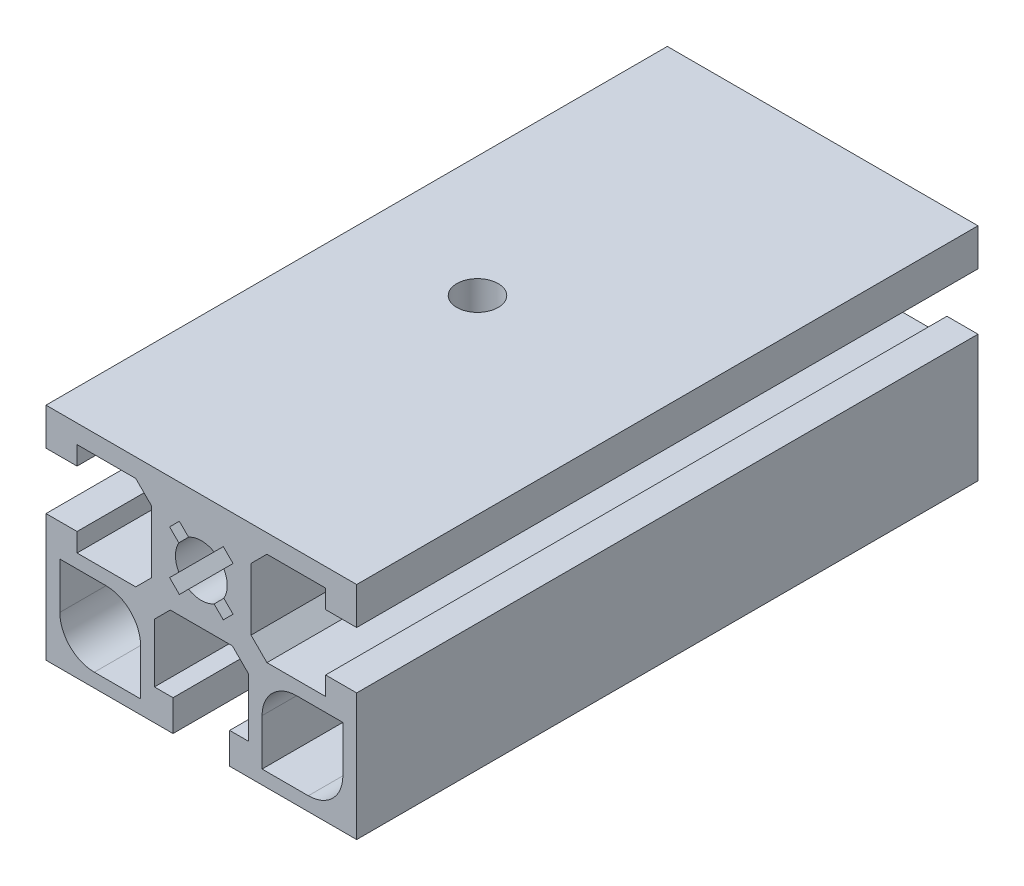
from build123d import *

# Parameters (mm, degrees)
EXTRUDE1_DEPTH           = 45
EXTRUDE1_DEPTH_BACK      = 45
F_6_0_6_DIAMETER_HOLE1_D = 6


with BuildPart() as part:
    # Sketch1 → Extrude1 (new, two sides: drawn at the far end of the back side and taken through both)
    with BuildSketch(Plane.XY.offset(-EXTRUDE1_DEPTH_BACK)):
        Polygon((-22.499999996, -22.499999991), (-4.099999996, -22.499999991), (-4.099999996, -17.999999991), (-6.799999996, -17.999999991), (-6.799999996, -9.499999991), (-4.499999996, -7.199999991), (4.500000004, -7.199999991), (6.800000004, -9.499999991), (6.800000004, -17.999999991), (4.100000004, -17.999999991), (4.100000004, -22.499999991), (22.499999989, -22.499999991), (22.499999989, -4.099999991), (17.999999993, -4.099999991), (17.999999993, -6.799999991), (9.499999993, -6.799999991), (7.199999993, -4.499999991), (7.199999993, 4.500000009), (9.499999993, 6.800000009), (17.999999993, 6.800000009), (17.999999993, 4.100000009), (22.499999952, 4.100000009), (22.499999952, 9.499999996), (-22.499999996, 9.499999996), (-22.499999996, 4.100000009), (-17.999999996, 4.100000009), (-17.999999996, 6.800000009), (-9.499999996, 6.800000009), (-7.199999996, 4.500000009), (-7.199999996, -4.499999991), (-9.499999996, -6.799999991), (-17.999999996, -6.799999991), (-17.999999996, -4.099999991), (-22.499999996, -4.099999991), align=None)
        with BuildLine():
            Line((-20.499997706, -15.500002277), (-20.499997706, -8.799997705))
            Line((-20.499997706, -8.799997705), (-13.799993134, -8.799997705))
            ThreePointArc((-13.799993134, -8.799997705), (-10.264459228, -10.264463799), (-8.799993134, -13.799997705))
            Line((-8.799993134, -13.799997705), (-8.799993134, -20.500002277))
            Line((-8.799993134, -20.500002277), (-15.499997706, -20.500002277))
            ThreePointArc((-15.499997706, -20.500002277), (-19.035531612, -19.035536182), (-20.499997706, -15.500002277))
        make_face(mode=Mode.SUBTRACT)
        with BuildLine():
            Line((8.799993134, -20.500002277), (8.799993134, -13.799997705))
            ThreePointArc((8.799993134, -13.799997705), (10.264459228, -10.264463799), (13.799993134, -8.799997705))
            Line((13.799993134, -8.799997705), (20.499997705, -8.799997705))
            Line((20.499997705, -8.799997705), (20.499997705, -15.500002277))
            ThreePointArc((20.499997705, -15.500002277), (19.035531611, -19.035536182), (15.499997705, -20.500002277))
            Line((15.499997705, -20.500002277), (8.799993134, -20.500002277))
        make_face(mode=Mode.SUBTRACT)
        with BuildLine():
            Line((-3.262737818, 1.848524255), (-4.596194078, 3.181980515))
            Line((-4.596194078, 3.181980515), (-3.181980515, 4.596194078))
            Line((-3.181980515, 4.596194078), (-1.848524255, 3.262737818))
            ThreePointArc((-1.848524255, 3.262737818), (0, 3.749999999), (1.848524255, 3.262737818))
            Line((1.848524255, 3.262737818), (3.181980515, 4.596194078))
            Line((3.181980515, 4.596194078), (4.596194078, 3.181980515))
            Line((4.596194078, 3.181980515), (3.262737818, 1.848524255))
            ThreePointArc((3.262737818, 1.848524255), (3.749999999, 0), (3.262737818, -1.848524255))
            Line((3.262737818, -1.848524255), (4.596194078, -3.181980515))
            Line((4.596194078, -3.181980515), (3.181980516, -4.596194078))
            Line((3.181980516, -4.596194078), (1.848524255, -3.262737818))
            ThreePointArc((1.848524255, -3.262737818), (0, -3.749999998), (-1.848524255, -3.262737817))
            Line((-1.848524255, -3.262737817), (-3.181980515, -4.596194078))
            Line((-3.181980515, -4.596194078), (-4.596194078, -3.181980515))
            Line((-4.596194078, -3.181980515), (-3.262737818, -1.848524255))
            ThreePointArc((-3.262737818, -1.848524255), (-3.749999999, 0), (-3.262737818, 1.848524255))
        make_face(mode=Mode.SUBTRACT)
    extrude(amount=EXTRUDE1_DEPTH + EXTRUDE1_DEPTH_BACK)

    # 6.0 _6_ Diameter Hole1 (through all)
    with Locations(Plane(origin=(-4.999999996, 9.499999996, 0), x_dir=(0, 0, 1), z_dir=(0, 1, 0))):
        with Locations((0, 0)):
            Hole(F_6_0_6_DIAMETER_HOLE1_D / 2)


solid = part.part
